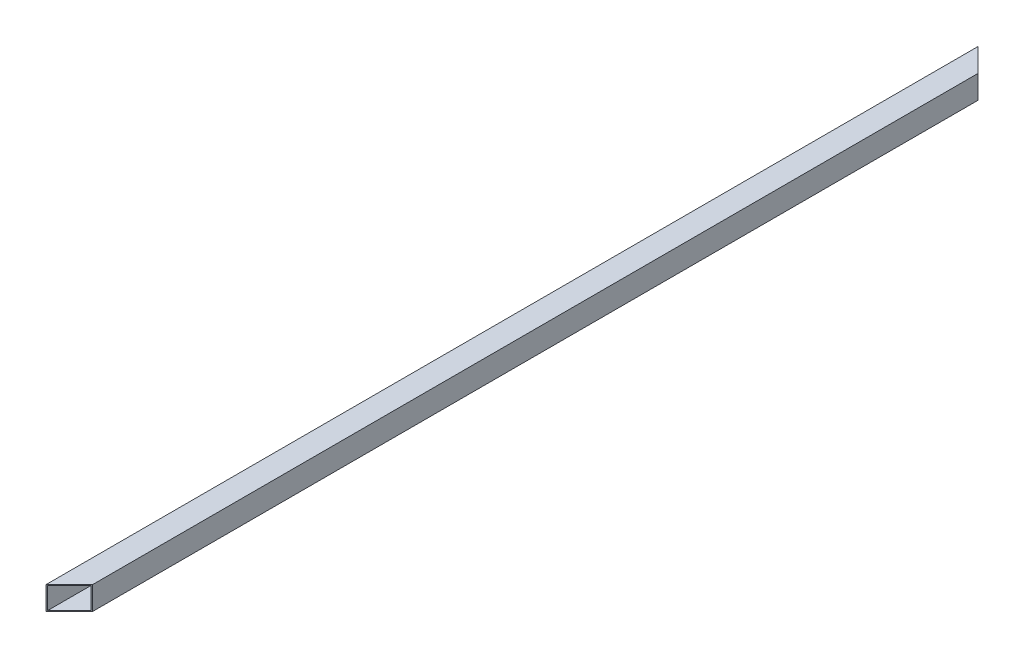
ISO-10303-21;
HEADER;
FILE_DESCRIPTION(('STEP AP214'),'2;1');
FILE_NAME('part.step','',(''),(''),'','','');
FILE_SCHEMA(('AUTOMOTIVE_DESIGN { 1 0 10303 214 1 1 1 1 }'));
ENDSEC;
DATA;
#1=APPLICATION_CONTEXT('core data for automotive mechanical design processes');
#2=APPLICATION_PROTOCOL_DEFINITION('international standard','automotive_design',2000,#1);
#3=PRODUCT_CONTEXT('',#1,'mechanical');
#4=PRODUCT('Part','Part','',(#3));
#5=PRODUCT_RELATED_PRODUCT_CATEGORY('part','',(#4));
#6=PRODUCT_DEFINITION_FORMATION('','',#4);
#7=PRODUCT_DEFINITION_CONTEXT('part definition',#1,'design');
#8=PRODUCT_DEFINITION('design','',#6,#7);
#9=PRODUCT_DEFINITION_SHAPE('','',#8);
#10=(LENGTH_UNIT() NAMED_UNIT(*) SI_UNIT(.MILLI.,.METRE.));
#11=(NAMED_UNIT(*) PLANE_ANGLE_UNIT() SI_UNIT($,.RADIAN.));
#12=(NAMED_UNIT(*) SI_UNIT($,.STERADIAN.) SOLID_ANGLE_UNIT());
#13=UNCERTAINTY_MEASURE_WITH_UNIT(LENGTH_MEASURE(1.E-05),#10,'distance_accuracy_value','');
#14=(GEOMETRIC_REPRESENTATION_CONTEXT(3) GLOBAL_UNCERTAINTY_ASSIGNED_CONTEXT((#13)) GLOBAL_UNIT_ASSIGNED_CONTEXT((#10,
#11,#12)) REPRESENTATION_CONTEXT('',''));
#15=CARTESIAN_POINT('',(0.,0.,0.));
#16=DIRECTION('',(0.,0.,1.));
#17=DIRECTION('',(1.,0.,0.));
#18=AXIS2_PLACEMENT_3D('',#15,#16,#17);
#19=CARTESIAN_POINT('',(14.9999999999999,-15.0000000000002,1200.));
#20=DIRECTION('',(-1.,0.,0.));
#21=DIRECTION('',(0.,0.,1.));
#22=AXIS2_PLACEMENT_3D('',#19,#20,#21);
#23=PLANE('',#22);
#24=DIRECTION('',(0.,1.,0.));
#25=VECTOR('',#24,1.);
#26=CARTESIAN_POINT('',(14.9999999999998,-15.0009999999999,1170.));
#27=LINE('',#26,#25);
#28=CARTESIAN_POINT('',(14.9999999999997,-15.,1170.));
#29=VERTEX_POINT('',#28);
#30=CARTESIAN_POINT('',(14.9999999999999,15.,1170.));
#31=VERTEX_POINT('',#30);
#32=EDGE_CURVE('E133',#29,#31,#27,.T.);
#33=ORIENTED_EDGE('',*,*,#32,.F.);
#34=DIRECTION('',(0.,0.,-1.));
#35=VECTOR('',#34,1.);
#36=CARTESIAN_POINT('',(14.9999999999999,-15.0000000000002,1200.));
#37=LINE('',#36,#35);
#38=CARTESIAN_POINT('',(15.,-15.,30.));
#39=VERTEX_POINT('',#38);
#40=EDGE_CURVE('E84',#29,#39,#37,.T.);
#41=ORIENTED_EDGE('',*,*,#40,.T.);
#42=DIRECTION('',(0.,1.,0.));
#43=VECTOR('',#42,1.);
#44=CARTESIAN_POINT('',(15.,-15.0010000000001,30.));
#45=LINE('',#44,#43);
#46=CARTESIAN_POINT('',(14.9999999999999,15.0000000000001,30.));
#47=VERTEX_POINT('',#46);
#48=EDGE_CURVE('E180',#39,#47,#45,.T.);
#49=ORIENTED_EDGE('',*,*,#48,.T.);
#50=DIRECTION('',(0.,0.,-1.));
#51=VECTOR('',#50,1.);
#52=CARTESIAN_POINT('',(14.9999999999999,15.,1200.));
#53=LINE('',#52,#51);
#54=EDGE_CURVE('E12',#31,#47,#53,.T.);
#55=ORIENTED_EDGE('',*,*,#54,.F.);
#56=EDGE_LOOP('',(#33,#41,#49,#55));
#57=FACE_BOUND('',#56,.T.);
#58=ADVANCED_FACE('F62',(#57),#23,.F.);
#59=CARTESIAN_POINT('',(-15.,14.9999999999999,1200.));
#60=DIRECTION('',(0.,-1.,0.));
#61=DIRECTION('',(0.,0.,-1.));
#62=AXIS2_PLACEMENT_3D('',#59,#60,#61);
#63=PLANE('',#62);
#64=DIRECTION('',(0.70710678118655,0.,-0.707106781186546));
#65=VECTOR('',#64,1.);
#66=CARTESIAN_POINT('',(-15.,14.9999999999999,1200.));
#67=LINE('',#66,#65);
#68=CARTESIAN_POINT('',(-15.,14.9999999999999,1200.));
#69=VERTEX_POINT('',#68);
#70=EDGE_CURVE('E175',#69,#31,#67,.T.);
#71=ORIENTED_EDGE('',*,*,#70,.T.);
#72=ORIENTED_EDGE('',*,*,#54,.T.);
#73=DIRECTION('',(0.70710678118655,0.,0.707106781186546));
#74=VECTOR('',#73,1.);
#75=CARTESIAN_POINT('',(-14.9999999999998,15.,0.));
#76=LINE('',#75,#74);
#77=CARTESIAN_POINT('',(-14.9999999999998,15.,0.));
#78=VERTEX_POINT('',#77);
#79=EDGE_CURVE('E178',#78,#47,#76,.T.);
#80=ORIENTED_EDGE('',*,*,#79,.F.);
#81=DIRECTION('',(0.,0.,-1.));
#82=VECTOR('',#81,1.);
#83=CARTESIAN_POINT('',(-15.,14.9999999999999,1200.));
#84=LINE('',#83,#82);
#85=EDGE_CURVE('E69',#69,#78,#84,.T.);
#86=ORIENTED_EDGE('',*,*,#85,.F.);
#87=EDGE_LOOP('',(#71,#72,#80,#86));
#88=FACE_BOUND('',#87,.T.);
#89=ADVANCED_FACE('F174',(#88),#63,.F.);
#90=CARTESIAN_POINT('',(-15.,-15.0000000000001,1200.));
#91=DIRECTION('',(0.,1.,0.));
#92=DIRECTION('',(0.,0.,1.));
#93=AXIS2_PLACEMENT_3D('',#90,#91,#92);
#94=PLANE('',#93);
#95=DIRECTION('',(-0.70710678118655,0.,0.707106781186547));
#96=VECTOR('',#95,1.);
#97=CARTESIAN_POINT('',(-15.,-15.0000000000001,1200.));
#98=LINE('',#97,#96);
#99=CARTESIAN_POINT('',(-15.,-15.0000000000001,1200.));
#100=VERTEX_POINT('',#99);
#101=EDGE_CURVE('E199',#29,#100,#98,.T.);
#102=ORIENTED_EDGE('',*,*,#101,.T.);
#103=DIRECTION('',(0.,0.,-1.));
#104=VECTOR('',#103,1.);
#105=CARTESIAN_POINT('',(-15.,-15.0000000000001,1200.));
#106=LINE('',#105,#104);
#107=CARTESIAN_POINT('',(-15.,-15.0000000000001,2.22044604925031E-13));
#108=VERTEX_POINT('',#107);
#109=EDGE_CURVE('E163',#100,#108,#106,.T.);
#110=ORIENTED_EDGE('',*,*,#109,.T.);
#111=DIRECTION('',(-0.70710678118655,0.,-0.707106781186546));
#112=VECTOR('',#111,1.);
#113=CARTESIAN_POINT('',(-15.,-15.0000000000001,2.22044604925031E-13));
#114=LINE('',#113,#112);
#115=EDGE_CURVE('E152',#39,#108,#114,.T.);
#116=ORIENTED_EDGE('',*,*,#115,.F.);
#117=ORIENTED_EDGE('',*,*,#40,.F.);
#118=EDGE_LOOP('',(#102,#110,#116,#117));
#119=FACE_BOUND('',#118,.T.);
#120=ADVANCED_FACE('F198',(#119),#94,.F.);
#121=CARTESIAN_POINT('',(14.,0.,1200.));
#122=DIRECTION('',(-1.,0.,0.));
#123=DIRECTION('',(0.,0.,1.));
#124=AXIS2_PLACEMENT_3D('',#121,#122,#123);
#125=PLANE('',#124);
#126=DIRECTION('',(0.,0.,-1.));
#127=VECTOR('',#126,1.);
#128=CARTESIAN_POINT('',(14.0000000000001,-14.0000000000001,1200.));
#129=LINE('',#128,#127);
#130=CARTESIAN_POINT('',(14.0000000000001,-14.,1171.));
#131=VERTEX_POINT('',#130);
#132=CARTESIAN_POINT('',(14.0000000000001,-13.9999999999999,29.0000000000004));
#133=VERTEX_POINT('',#132);
#134=EDGE_CURVE('E148',#131,#133,#129,.T.);
#135=ORIENTED_EDGE('',*,*,#134,.F.);
#136=DIRECTION('',(0.,-1.,0.));
#137=VECTOR('',#136,1.);
#138=CARTESIAN_POINT('',(14.,-15.001,1171.));
#139=LINE('',#138,#137);
#140=CARTESIAN_POINT('',(14.,14.,1171.));
#141=VERTEX_POINT('',#140);
#142=EDGE_CURVE('E76',#141,#131,#139,.T.);
#143=ORIENTED_EDGE('',*,*,#142,.F.);
#144=DIRECTION('',(0.,0.,-1.));
#145=VECTOR('',#144,1.);
#146=CARTESIAN_POINT('',(14.,13.9999999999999,1200.));
#147=LINE('',#146,#145);
#148=CARTESIAN_POINT('',(14.0000000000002,14.0000000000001,29.0000000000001));
#149=VERTEX_POINT('',#148);
#150=EDGE_CURVE('E150',#141,#149,#147,.T.);
#151=ORIENTED_EDGE('',*,*,#150,.T.);
#152=DIRECTION('',(0.,-1.,0.));
#153=VECTOR('',#152,1.);
#154=CARTESIAN_POINT('',(14.0000000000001,-15.0010000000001,28.9999999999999));
#155=LINE('',#154,#153);
#156=EDGE_CURVE('E192',#149,#133,#155,.T.);
#157=ORIENTED_EDGE('',*,*,#156,.T.);
#158=EDGE_LOOP('',(#135,#143,#151,#157));
#159=FACE_BOUND('',#158,.T.);
#160=ADVANCED_FACE('F206',(#159),#125,.T.);
#161=CARTESIAN_POINT('',(0.,14.0000000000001,1200.));
#162=DIRECTION('',(0.,-1.,0.));
#163=DIRECTION('',(0.,0.,-1.));
#164=AXIS2_PLACEMENT_3D('',#161,#162,#163);
#165=PLANE('',#164);
#166=ORIENTED_EDGE('',*,*,#150,.F.);
#167=DIRECTION('',(0.70710678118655,0.,-0.707106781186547));
#168=VECTOR('',#167,1.);
#169=CARTESIAN_POINT('',(-14.9999999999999,14.,1200.));
#170=LINE('',#169,#168);
#171=CARTESIAN_POINT('',(-14.0000000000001,14.,1199.));
#172=VERTEX_POINT('',#171);
#173=EDGE_CURVE('E142',#172,#141,#170,.T.);
#174=ORIENTED_EDGE('',*,*,#173,.F.);
#175=DIRECTION('',(0.,0.,-1.));
#176=VECTOR('',#175,1.);
#177=CARTESIAN_POINT('',(-14.0000000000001,13.9999999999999,1200.));
#178=LINE('',#177,#176);
#179=CARTESIAN_POINT('',(-13.9999999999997,13.9999999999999,1.00000000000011));
#180=VERTEX_POINT('',#179);
#181=EDGE_CURVE('E141',#172,#180,#178,.T.);
#182=ORIENTED_EDGE('',*,*,#181,.T.);
#183=DIRECTION('',(0.70710678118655,0.,0.707106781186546));
#184=VECTOR('',#183,1.);
#185=CARTESIAN_POINT('',(-15.,14.0000000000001,0.));
#186=LINE('',#185,#184);
#187=EDGE_CURVE('E189',#180,#149,#186,.T.);
#188=ORIENTED_EDGE('',*,*,#187,.T.);
#189=EDGE_LOOP('',(#166,#174,#182,#188));
#190=FACE_BOUND('',#189,.T.);
#191=ADVANCED_FACE('F208',(#190),#165,.T.);
#192=CARTESIAN_POINT('',(-14.,0.,1200.));
#193=DIRECTION('',(1.,0.,0.));
#194=DIRECTION('',(0.,0.,-1.));
#195=AXIS2_PLACEMENT_3D('',#192,#193,#194);
#196=PLANE('',#195);
#197=ORIENTED_EDGE('',*,*,#181,.F.);
#198=DIRECTION('',(0.,1.,0.));
#199=VECTOR('',#198,1.);
#200=CARTESIAN_POINT('',(-14.,-15.0009999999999,1199.));
#201=LINE('',#200,#199);
#202=CARTESIAN_POINT('',(-14.0000000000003,-13.9999999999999,1199.));
#203=VERTEX_POINT('',#202);
#204=EDGE_CURVE('E128',#203,#172,#201,.T.);
#205=ORIENTED_EDGE('',*,*,#204,.F.);
#206=DIRECTION('',(0.,0.,-1.));
#207=VECTOR('',#206,1.);
#208=CARTESIAN_POINT('',(-14.0000000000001,-14.0000000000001,1200.));
#209=LINE('',#208,#207);
#210=CARTESIAN_POINT('',(-13.9999999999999,-14.,1.00000000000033));
#211=VERTEX_POINT('',#210);
#212=EDGE_CURVE('E139',#203,#211,#209,.T.);
#213=ORIENTED_EDGE('',*,*,#212,.T.);
#214=DIRECTION('',(0.,1.,0.));
#215=VECTOR('',#214,1.);
#216=CARTESIAN_POINT('',(-14.,-15.0009999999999,0.999999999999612));
#217=LINE('',#216,#215);
#218=EDGE_CURVE('E187',#211,#180,#217,.T.);
#219=ORIENTED_EDGE('',*,*,#218,.T.);
#220=EDGE_LOOP('',(#197,#205,#213,#219));
#221=FACE_BOUND('',#220,.T.);
#222=ADVANCED_FACE('F137',(#221),#196,.T.);
#223=CARTESIAN_POINT('',(0.,-13.9999999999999,1200.));
#224=DIRECTION('',(0.,1.,0.));
#225=DIRECTION('',(0.,0.,1.));
#226=AXIS2_PLACEMENT_3D('',#223,#224,#225);
#227=PLANE('',#226);
#228=ORIENTED_EDGE('',*,*,#212,.F.);
#229=DIRECTION('',(-0.70710678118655,0.,0.707106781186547));
#230=VECTOR('',#229,1.);
#231=CARTESIAN_POINT('',(-14.9999999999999,-13.9999999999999,1200.));
#232=LINE('',#231,#230);
#233=EDGE_CURVE('E124',#131,#203,#232,.T.);
#234=ORIENTED_EDGE('',*,*,#233,.F.);
#235=ORIENTED_EDGE('',*,*,#134,.T.);
#236=DIRECTION('',(-0.70710678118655,0.,-0.707106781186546));
#237=VECTOR('',#236,1.);
#238=CARTESIAN_POINT('',(-15.0000000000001,-14.,-2.22044604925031E-13));
#239=LINE('',#238,#237);
#240=EDGE_CURVE('E147',#133,#211,#239,.T.);
#241=ORIENTED_EDGE('',*,*,#240,.T.);
#242=EDGE_LOOP('',(#228,#234,#235,#241));
#243=FACE_BOUND('',#242,.T.);
#244=ADVANCED_FACE('F145',(#243),#227,.T.);
#245=CARTESIAN_POINT('',(-15.,-15.0000000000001,1200.));
#246=DIRECTION('',(1.,0.,0.));
#247=DIRECTION('',(0.,0.,-1.));
#248=AXIS2_PLACEMENT_3D('',#245,#246,#247);
#249=PLANE('',#248);
#250=DIRECTION('',(0.,-1.,0.));
#251=VECTOR('',#250,1.);
#252=CARTESIAN_POINT('',(-15.,-15.0000000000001,2.22044604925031E-13));
#253=LINE('',#252,#251);
#254=EDGE_CURVE('E157',#78,#108,#253,.T.);
#255=ORIENTED_EDGE('',*,*,#254,.T.);
#256=ORIENTED_EDGE('',*,*,#109,.F.);
#257=DIRECTION('',(0.,-1.,0.));
#258=VECTOR('',#257,1.);
#259=CARTESIAN_POINT('',(-15.,-15.0000000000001,1200.));
#260=LINE('',#259,#258);
#261=EDGE_CURVE('E158',#69,#100,#260,.T.);
#262=ORIENTED_EDGE('',*,*,#261,.F.);
#263=ORIENTED_EDGE('',*,*,#85,.T.);
#264=EDGE_LOOP('',(#255,#256,#262,#263));
#265=FACE_BOUND('',#264,.T.);
#266=ADVANCED_FACE('F169',(#265),#249,.F.);
#267=CARTESIAN_POINT('',(-15.,-15.0010000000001,-2.77555756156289E-13));
#268=DIRECTION('',(-0.707106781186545,0.,0.707106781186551));
#269=DIRECTION('',(0.70710678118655,0.,0.707106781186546));
#270=AXIS2_PLACEMENT_3D('',#267,#268,#269);
#271=PLANE('',#270);
#272=ORIENTED_EDGE('',*,*,#187,.F.);
#273=ORIENTED_EDGE('',*,*,#218,.F.);
#274=ORIENTED_EDGE('',*,*,#240,.F.);
#275=ORIENTED_EDGE('',*,*,#156,.F.);
#276=EDGE_LOOP('',(#272,#273,#274,#275));
#277=FACE_BOUND('',#276,.T.);
#278=ORIENTED_EDGE('',*,*,#115,.T.);
#279=ORIENTED_EDGE('',*,*,#254,.F.);
#280=ORIENTED_EDGE('',*,*,#79,.T.);
#281=ORIENTED_EDGE('',*,*,#48,.F.);
#282=EDGE_LOOP('',(#278,#279,#280,#281));
#283=FACE_BOUND('',#282,.T.);
#284=ADVANCED_FACE('F195',(#277,#283),#271,.F.);
#285=CARTESIAN_POINT('',(-15.0000000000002,-15.0009999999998,1200.));
#286=DIRECTION('',(0.707106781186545,0.,0.707106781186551));
#287=DIRECTION('',(0.70710678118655,0.,-0.707106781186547));
#288=AXIS2_PLACEMENT_3D('',#285,#286,#287);
#289=PLANE('',#288);
#290=ORIENTED_EDGE('',*,*,#142,.T.);
#291=ORIENTED_EDGE('',*,*,#233,.T.);
#292=ORIENTED_EDGE('',*,*,#204,.T.);
#293=ORIENTED_EDGE('',*,*,#173,.T.);
#294=EDGE_LOOP('',(#290,#291,#292,#293));
#295=FACE_BOUND('',#294,.T.);
#296=ORIENTED_EDGE('',*,*,#32,.T.);
#297=ORIENTED_EDGE('',*,*,#70,.F.);
#298=ORIENTED_EDGE('',*,*,#261,.T.);
#299=ORIENTED_EDGE('',*,*,#101,.F.);
#300=EDGE_LOOP('',(#296,#297,#298,#299));
#301=FACE_BOUND('',#300,.T.);
#302=ADVANCED_FACE('F126',(#295,#301),#289,.T.);
#303=CLOSED_SHELL('',(#58,#89,#120,#160,#191,#222,#244,#266,#284,#302));
#304=MANIFOLD_SOLID_BREP('B2',#303);
#305=ADVANCED_BREP_SHAPE_REPRESENTATION('',(#18,#304),#14);
#306=SHAPE_DEFINITION_REPRESENTATION(#9,#305);
ENDSEC;
END-ISO-10303-21;
